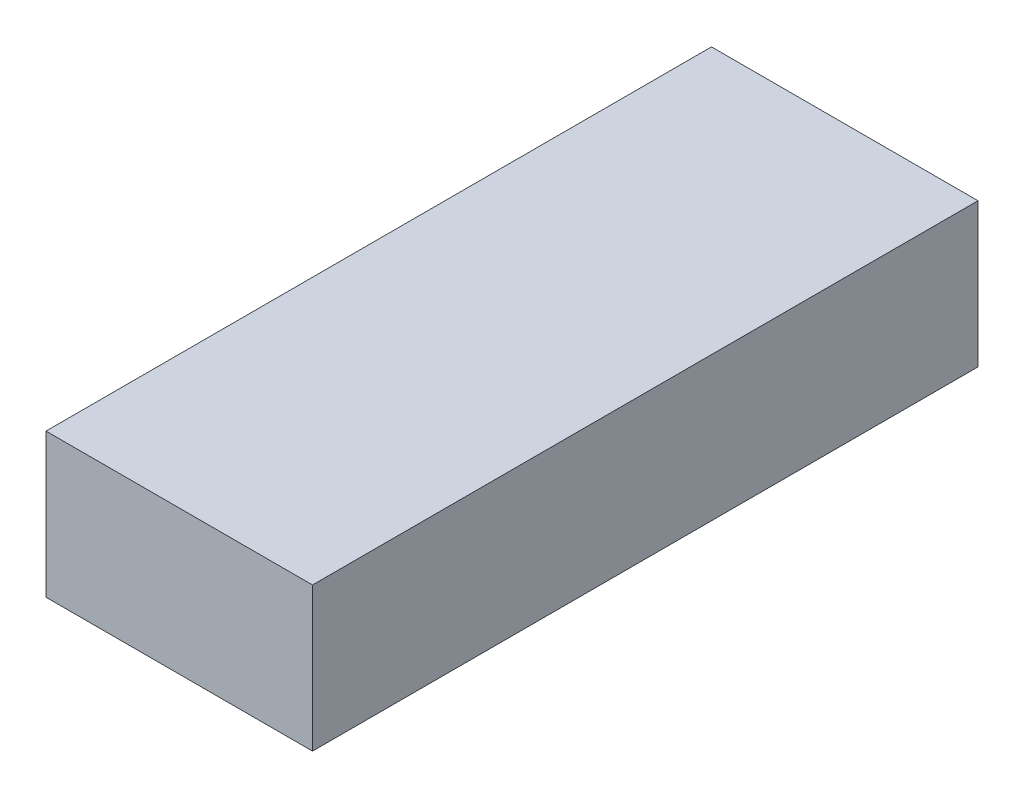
ISO-10303-21;
HEADER;
FILE_DESCRIPTION(('STEP AP214'),'2;1');
FILE_NAME('part.step','',(''),(''),'','','');
FILE_SCHEMA(('AUTOMOTIVE_DESIGN { 1 0 10303 214 1 1 1 1 }'));
ENDSEC;
DATA;
#1=APPLICATION_CONTEXT('core data for automotive mechanical design processes');
#2=APPLICATION_PROTOCOL_DEFINITION('international standard','automotive_design',2000,#1);
#3=PRODUCT_CONTEXT('',#1,'mechanical');
#4=PRODUCT('Part','Part','',(#3));
#5=PRODUCT_RELATED_PRODUCT_CATEGORY('part','',(#4));
#6=PRODUCT_DEFINITION_FORMATION('','',#4);
#7=PRODUCT_DEFINITION_CONTEXT('part definition',#1,'design');
#8=PRODUCT_DEFINITION('design','',#6,#7);
#9=PRODUCT_DEFINITION_SHAPE('','',#8);
#10=(LENGTH_UNIT() NAMED_UNIT(*) SI_UNIT(.MILLI.,.METRE.));
#11=(NAMED_UNIT(*) PLANE_ANGLE_UNIT() SI_UNIT($,.RADIAN.));
#12=(NAMED_UNIT(*) SI_UNIT($,.STERADIAN.) SOLID_ANGLE_UNIT());
#13=UNCERTAINTY_MEASURE_WITH_UNIT(LENGTH_MEASURE(1.E-05),#10,'distance_accuracy_value','');
#14=(GEOMETRIC_REPRESENTATION_CONTEXT(3) GLOBAL_UNCERTAINTY_ASSIGNED_CONTEXT((#13)) GLOBAL_UNIT_ASSIGNED_CONTEXT((#10,
#11,#12)) REPRESENTATION_CONTEXT('',''));
#15=CARTESIAN_POINT('',(0.,0.,0.));
#16=DIRECTION('',(0.,0.,1.));
#17=DIRECTION('',(1.,0.,0.));
#18=AXIS2_PLACEMENT_3D('',#15,#16,#17);
#19=CARTESIAN_POINT('',(-3.94319828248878,4.33039891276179,24.97));
#20=DIRECTION('',(1.,0.,0.));
#21=DIRECTION('',(0.,0.,-1.));
#22=AXIS2_PLACEMENT_3D('',#19,#20,#21);
#23=PLANE('',#22);
#24=DIRECTION('',(0.,-1.,0.));
#25=VECTOR('',#24,1.);
#26=CARTESIAN_POINT('',(-3.94319828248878,4.33039891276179,0.));
#27=LINE('',#26,#25);
#28=CARTESIAN_POINT('',(-3.94319828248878,4.33039891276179,0.));
#29=VERTEX_POINT('',#28);
#30=CARTESIAN_POINT('',(-3.94319828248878,-1.06960108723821,0.));
#31=VERTEX_POINT('',#30);
#32=EDGE_CURVE('E102',#29,#31,#27,.T.);
#33=ORIENTED_EDGE('',*,*,#32,.T.);
#34=DIRECTION('',(0.,0.,-1.));
#35=VECTOR('',#34,1.);
#36=CARTESIAN_POINT('',(-3.94319828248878,-1.06960108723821,24.97));
#37=LINE('',#36,#35);
#38=CARTESIAN_POINT('',(-3.94319828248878,-1.06960108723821,24.97));
#39=VERTEX_POINT('',#38);
#40=EDGE_CURVE('E11',#39,#31,#37,.T.);
#41=ORIENTED_EDGE('',*,*,#40,.F.);
#42=DIRECTION('',(0.,-1.,0.));
#43=VECTOR('',#42,1.);
#44=CARTESIAN_POINT('',(-3.94319828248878,4.33039891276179,24.97));
#45=LINE('',#44,#43);
#46=CARTESIAN_POINT('',(-3.94319828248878,4.33039891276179,24.97));
#47=VERTEX_POINT('',#46);
#48=EDGE_CURVE('E90',#47,#39,#45,.T.);
#49=ORIENTED_EDGE('',*,*,#48,.F.);
#50=DIRECTION('',(0.,0.,-1.));
#51=VECTOR('',#50,1.);
#52=CARTESIAN_POINT('',(-3.94319828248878,4.33039891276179,24.97));
#53=LINE('',#52,#51);
#54=EDGE_CURVE('E98',#47,#29,#53,.T.);
#55=ORIENTED_EDGE('',*,*,#54,.T.);
#56=EDGE_LOOP('',(#33,#41,#49,#55));
#57=FACE_BOUND('',#56,.T.);
#58=ADVANCED_FACE('F39',(#57),#23,.F.);
#59=CARTESIAN_POINT('',(-3.94319828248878,-1.06960108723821,24.97));
#60=DIRECTION('',(0.,1.,0.));
#61=DIRECTION('',(0.,0.,1.));
#62=AXIS2_PLACEMENT_3D('',#59,#60,#61);
#63=PLANE('',#62);
#64=DIRECTION('',(1.,0.,0.));
#65=VECTOR('',#64,1.);
#66=CARTESIAN_POINT('',(-3.94319828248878,-1.06960108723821,0.));
#67=LINE('',#66,#65);
#68=CARTESIAN_POINT('',(6.05680171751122,-1.06960108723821,0.));
#69=VERTEX_POINT('',#68);
#70=EDGE_CURVE('E94',#31,#69,#67,.T.);
#71=ORIENTED_EDGE('',*,*,#70,.T.);
#72=DIRECTION('',(0.,0.,-1.));
#73=VECTOR('',#72,1.);
#74=CARTESIAN_POINT('',(6.05680171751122,-1.06960108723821,24.97));
#75=LINE('',#74,#73);
#76=CARTESIAN_POINT('',(6.05680171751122,-1.06960108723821,24.97));
#77=VERTEX_POINT('',#76);
#78=EDGE_CURVE('E47',#77,#69,#75,.T.);
#79=ORIENTED_EDGE('',*,*,#78,.F.);
#80=DIRECTION('',(1.,0.,0.));
#81=VECTOR('',#80,1.);
#82=CARTESIAN_POINT('',(-3.94319828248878,-1.06960108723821,24.97));
#83=LINE('',#82,#81);
#84=EDGE_CURVE('E85',#39,#77,#83,.T.);
#85=ORIENTED_EDGE('',*,*,#84,.F.);
#86=ORIENTED_EDGE('',*,*,#40,.T.);
#87=EDGE_LOOP('',(#71,#79,#85,#86));
#88=FACE_BOUND('',#87,.T.);
#89=ADVANCED_FACE('F93',(#88),#63,.F.);
#90=CARTESIAN_POINT('',(6.05680171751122,4.33039891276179,24.97));
#91=DIRECTION('',(-1.,0.,0.));
#92=DIRECTION('',(0.,0.,1.));
#93=AXIS2_PLACEMENT_3D('',#90,#91,#92);
#94=PLANE('',#93);
#95=DIRECTION('',(0.,1.,0.));
#96=VECTOR('',#95,1.);
#97=CARTESIAN_POINT('',(6.05680171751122,4.33039891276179,0.));
#98=LINE('',#97,#96);
#99=CARTESIAN_POINT('',(6.05680171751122,4.33039891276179,0.));
#100=VERTEX_POINT('',#99);
#101=EDGE_CURVE('E72',#69,#100,#98,.T.);
#102=ORIENTED_EDGE('',*,*,#101,.T.);
#103=DIRECTION('',(0.,0.,-1.));
#104=VECTOR('',#103,1.);
#105=CARTESIAN_POINT('',(6.05680171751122,4.33039891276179,24.97));
#106=LINE('',#105,#104);
#107=CARTESIAN_POINT('',(6.05680171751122,4.33039891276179,24.97));
#108=VERTEX_POINT('',#107);
#109=EDGE_CURVE('E95',#108,#100,#106,.T.);
#110=ORIENTED_EDGE('',*,*,#109,.F.);
#111=DIRECTION('',(0.,1.,0.));
#112=VECTOR('',#111,1.);
#113=CARTESIAN_POINT('',(6.05680171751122,4.33039891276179,24.97));
#114=LINE('',#113,#112);
#115=EDGE_CURVE('E88',#77,#108,#114,.T.);
#116=ORIENTED_EDGE('',*,*,#115,.F.);
#117=ORIENTED_EDGE('',*,*,#78,.T.);
#118=EDGE_LOOP('',(#102,#110,#116,#117));
#119=FACE_BOUND('',#118,.T.);
#120=ADVANCED_FACE('F96',(#119),#94,.F.);
#121=CARTESIAN_POINT('',(-3.94319828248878,4.33039891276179,24.97));
#122=DIRECTION('',(0.,-1.,0.));
#123=DIRECTION('',(0.,0.,-1.));
#124=AXIS2_PLACEMENT_3D('',#121,#122,#123);
#125=PLANE('',#124);
#126=DIRECTION('',(-1.,0.,0.));
#127=VECTOR('',#126,1.);
#128=CARTESIAN_POINT('',(-3.94319828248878,4.33039891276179,0.));
#129=LINE('',#128,#127);
#130=EDGE_CURVE('E78',#100,#29,#129,.T.);
#131=ORIENTED_EDGE('',*,*,#130,.T.);
#132=ORIENTED_EDGE('',*,*,#54,.F.);
#133=DIRECTION('',(-1.,0.,0.));
#134=VECTOR('',#133,1.);
#135=CARTESIAN_POINT('',(-3.94319828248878,4.33039891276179,24.97));
#136=LINE('',#135,#134);
#137=EDGE_CURVE('E55',#108,#47,#136,.T.);
#138=ORIENTED_EDGE('',*,*,#137,.F.);
#139=ORIENTED_EDGE('',*,*,#109,.T.);
#140=EDGE_LOOP('',(#131,#132,#138,#139));
#141=FACE_BOUND('',#140,.T.);
#142=ADVANCED_FACE('F109',(#141),#125,.F.);
#143=CARTESIAN_POINT('',(0.,0.,24.97));
#144=DIRECTION('',(0.,0.,1.));
#145=DIRECTION('',(1.,0.,0.));
#146=AXIS2_PLACEMENT_3D('',#143,#144,#145);
#147=PLANE('',#146);
#148=ORIENTED_EDGE('',*,*,#48,.T.);
#149=ORIENTED_EDGE('',*,*,#84,.T.);
#150=ORIENTED_EDGE('',*,*,#115,.T.);
#151=ORIENTED_EDGE('',*,*,#137,.T.);
#152=EDGE_LOOP('',(#148,#149,#150,#151));
#153=FACE_BOUND('',#152,.T.);
#154=ADVANCED_FACE('F86',(#153),#147,.T.);
#155=CARTESIAN_POINT('',(0.,0.,0.));
#156=DIRECTION('',(0.,0.,1.));
#157=DIRECTION('',(1.,0.,0.));
#158=AXIS2_PLACEMENT_3D('',#155,#156,#157);
#159=PLANE('',#158);
#160=ORIENTED_EDGE('',*,*,#32,.F.);
#161=ORIENTED_EDGE('',*,*,#130,.F.);
#162=ORIENTED_EDGE('',*,*,#101,.F.);
#163=ORIENTED_EDGE('',*,*,#70,.F.);
#164=EDGE_LOOP('',(#160,#161,#162,#163));
#165=FACE_BOUND('',#164,.T.);
#166=ADVANCED_FACE('F112',(#165),#159,.F.);
#167=CLOSED_SHELL('',(#58,#89,#120,#142,#154,#166));
#168=MANIFOLD_SOLID_BREP('B2',#167);
#169=ADVANCED_BREP_SHAPE_REPRESENTATION('',(#18,#168),#14);
#170=SHAPE_DEFINITION_REPRESENTATION(#9,#169);
ENDSEC;
END-ISO-10303-21;
